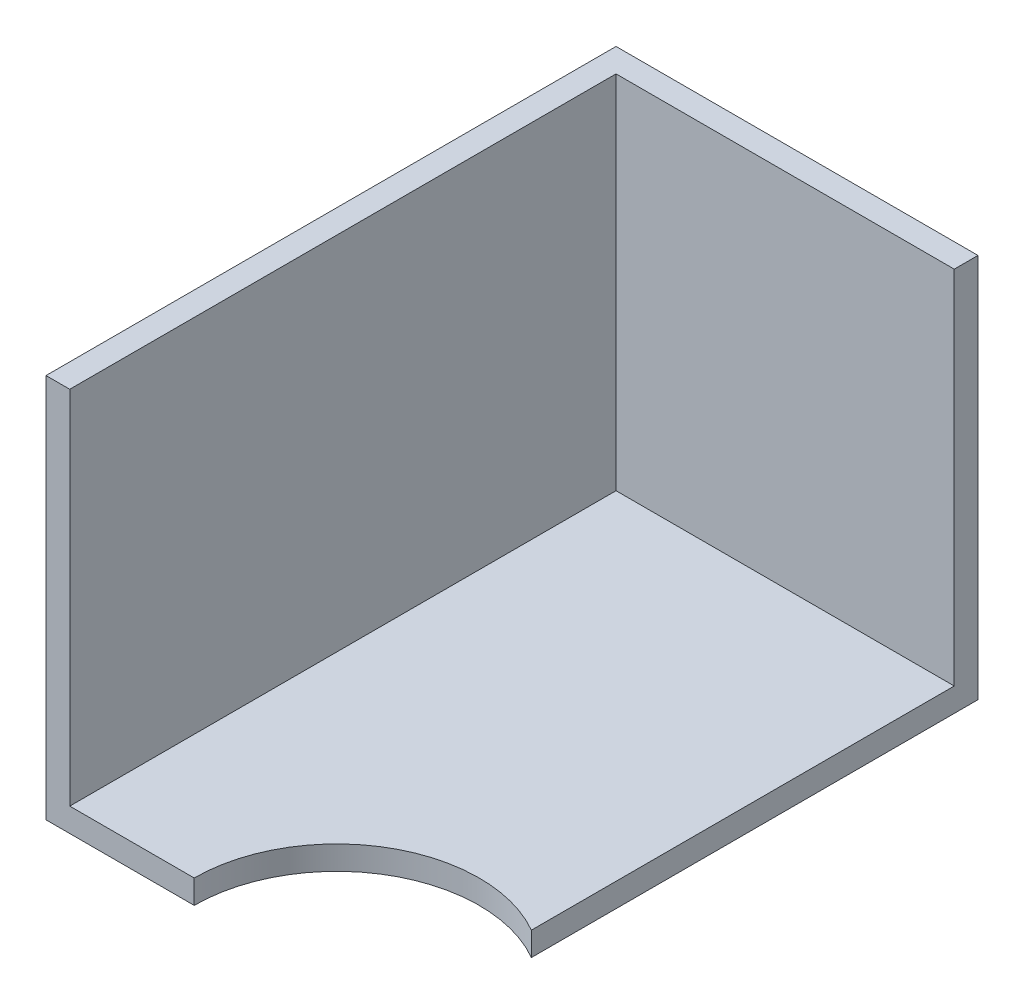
from build123d import *

# Parameters (mm, degrees)
SKETCH1_W           = 76.2
SKETCH1_H           = 120
BOSS_EXTRUDE1_DEPTH = 5
BOSS_EXTRUDE2_DEPTH = 76
SKETCH3_R           = 30
CUT_EXTRUDE1_DEPTH  = 105.055802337


with BuildPart() as part:
    # Sketch1 → Boss-Extrude1 (new body)
    with BuildSketch(Plane(origin=(0, 0, 0), x_dir=(1, 0, 0), z_dir=(0, 1, 0))):
        Rectangle(SKETCH1_W, SKETCH1_H)
    extrude(amount=BOSS_EXTRUDE1_DEPTH)

    # Sketch2 → Boss-Extrude2 (add)
    with BuildSketch(Plane(origin=(0, 5, 0), x_dir=(1, 0, 0), z_dir=(0, 1, 0))):
        Polygon((-38.1, -60), (-38.1, 60), (38.1, 60), (38.1, 55), (-33.1, 55), (-33.1, -60), align=None)
    extrude(amount=BOSS_EXTRUDE2_DEPTH)

    # Sketch3 → Cut-Extrude1 (cut, through all)
    with BuildSketch(Plane(origin=(0, 5, 0), x_dir=(1, 0, 0), z_dir=(0, 1, 0))):
        with Locations((23.1, -60)):
            Circle(SKETCH3_R)
    extrude(amount=-CUT_EXTRUDE1_DEPTH, mode=Mode.SUBTRACT)


solid = part.part
